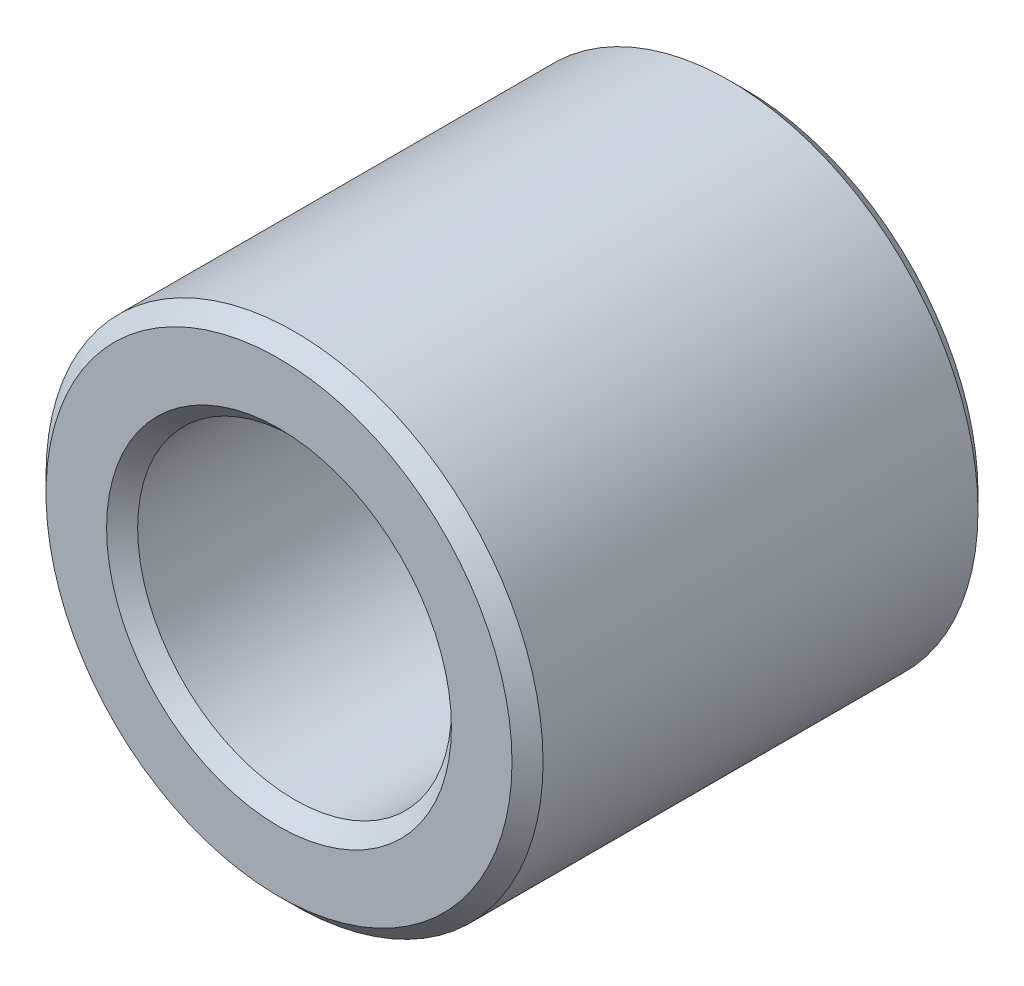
ISO-10303-21;
HEADER;
FILE_DESCRIPTION(('STEP AP214'),'2;1');
FILE_NAME('part.step','',(''),(''),'','','');
FILE_SCHEMA(('AUTOMOTIVE_DESIGN { 1 0 10303 214 1 1 1 1 }'));
ENDSEC;
DATA;
#1=APPLICATION_CONTEXT('core data for automotive mechanical design processes');
#2=APPLICATION_PROTOCOL_DEFINITION('international standard','automotive_design',2000,#1);
#3=PRODUCT_CONTEXT('',#1,'mechanical');
#4=PRODUCT('Part','Part','',(#3));
#5=PRODUCT_RELATED_PRODUCT_CATEGORY('part','',(#4));
#6=PRODUCT_DEFINITION_FORMATION('','',#4);
#7=PRODUCT_DEFINITION_CONTEXT('part definition',#1,'design');
#8=PRODUCT_DEFINITION('design','',#6,#7);
#9=PRODUCT_DEFINITION_SHAPE('','',#8);
#10=(LENGTH_UNIT() NAMED_UNIT(*) SI_UNIT(.MILLI.,.METRE.));
#11=(NAMED_UNIT(*) PLANE_ANGLE_UNIT() SI_UNIT($,.RADIAN.));
#12=(NAMED_UNIT(*) SI_UNIT($,.STERADIAN.) SOLID_ANGLE_UNIT());
#13=UNCERTAINTY_MEASURE_WITH_UNIT(LENGTH_MEASURE(1.E-05),#10,'distance_accuracy_value','');
#14=(GEOMETRIC_REPRESENTATION_CONTEXT(3) GLOBAL_UNCERTAINTY_ASSIGNED_CONTEXT((#13)) GLOBAL_UNIT_ASSIGNED_CONTEXT((#10,
#11,#12)) REPRESENTATION_CONTEXT('',''));
#15=CARTESIAN_POINT('',(0.,0.,0.));
#16=DIRECTION('',(0.,0.,1.));
#17=DIRECTION('',(1.,0.,0.));
#18=AXIS2_PLACEMENT_3D('',#15,#16,#17);
#19=CARTESIAN_POINT('',(0.,0.,15.));
#20=DIRECTION('',(0.,0.,1.));
#21=DIRECTION('',(1.,0.,0.));
#22=AXIS2_PLACEMENT_3D('',#19,#20,#21);
#23=PLANE('',#22);
#24=CARTESIAN_POINT('',(0.,0.,15.));
#25=DIRECTION('',(0.,0.,1.));
#26=DIRECTION('',(1.,0.,0.));
#27=AXIS2_PLACEMENT_3D('',#24,#25,#26);
#28=CIRCLE('',#27,5.55);
#29=CARTESIAN_POINT('',(5.55,0.,15.));
#30=VERTEX_POINT('',#29);
#31=EDGE_CURVE('E10',#30,#30,#28,.F.);
#32=ORIENTED_EDGE('',*,*,#31,.T.);
#33=EDGE_LOOP('',(#32));
#34=FACE_BOUND('',#33,.T.);
#35=CARTESIAN_POINT('',(0.,0.,15.));
#36=DIRECTION('',(0.,0.,1.));
#37=DIRECTION('',(1.,0.,0.));
#38=AXIS2_PLACEMENT_3D('',#35,#36,#37);
#39=CIRCLE('',#38,7.49999999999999);
#40=CARTESIAN_POINT('',(7.49999999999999,0.,15.));
#41=VERTEX_POINT('',#40);
#42=EDGE_CURVE('E36',#41,#41,#39,.T.);
#43=ORIENTED_EDGE('',*,*,#42,.T.);
#44=EDGE_LOOP('',(#43));
#45=FACE_BOUND('',#44,.T.);
#46=ADVANCED_FACE('F29',(#34,#45),#23,.T.);
#47=CARTESIAN_POINT('',(0.,0.,0.));
#48=DIRECTION('',(0.,0.,1.));
#49=DIRECTION('',(1.,0.,0.));
#50=AXIS2_PLACEMENT_3D('',#47,#48,#49);
#51=PLANE('',#50);
#52=CARTESIAN_POINT('',(0.,0.,0.));
#53=DIRECTION('',(0.,0.,1.));
#54=DIRECTION('',(1.,0.,0.));
#55=AXIS2_PLACEMENT_3D('',#52,#53,#54);
#56=CIRCLE('',#55,5.55);
#57=CARTESIAN_POINT('',(5.55,0.,0.));
#58=VERTEX_POINT('',#57);
#59=EDGE_CURVE('E55',#58,#58,#56,.T.);
#60=ORIENTED_EDGE('',*,*,#59,.T.);
#61=EDGE_LOOP('',(#60));
#62=FACE_BOUND('',#61,.T.);
#63=CARTESIAN_POINT('',(0.,0.,0.));
#64=DIRECTION('',(0.,0.,1.));
#65=DIRECTION('',(1.,0.,0.));
#66=AXIS2_PLACEMENT_3D('',#63,#64,#65);
#67=CIRCLE('',#66,7.49999999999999);
#68=CARTESIAN_POINT('',(7.49999999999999,0.,0.));
#69=VERTEX_POINT('',#68);
#70=EDGE_CURVE('E58',#69,#69,#67,.F.);
#71=ORIENTED_EDGE('',*,*,#70,.T.);
#72=EDGE_LOOP('',(#71));
#73=FACE_BOUND('',#72,.T.);
#74=ADVANCED_FACE('F62',(#62,#73),#51,.F.);
#75=CARTESIAN_POINT('',(0.,0.,15.));
#76=DIRECTION('',(0.,0.,-1.));
#77=DIRECTION('',(-1.,0.,0.));
#78=AXIS2_PLACEMENT_3D('',#75,#76,#77);
#79=CYLINDRICAL_SURFACE('',#78,8.);
#80=CARTESIAN_POINT('',(0.,0.,0.500000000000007));
#81=DIRECTION('',(0.,0.,1.));
#82=DIRECTION('',(1.,0.,0.));
#83=AXIS2_PLACEMENT_3D('',#80,#81,#82);
#84=CIRCLE('',#83,8.);
#85=CARTESIAN_POINT('',(8.,0.,0.500000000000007));
#86=VERTEX_POINT('',#85);
#87=EDGE_CURVE('E40',#86,#86,#84,.T.);
#88=ORIENTED_EDGE('',*,*,#87,.T.);
#89=EDGE_LOOP('',(#88));
#90=FACE_BOUND('',#89,.T.);
#91=CARTESIAN_POINT('',(0.,0.,14.5));
#92=DIRECTION('',(0.,0.,1.));
#93=DIRECTION('',(1.,0.,0.));
#94=AXIS2_PLACEMENT_3D('',#91,#92,#93);
#95=CIRCLE('',#94,8.);
#96=CARTESIAN_POINT('',(8.,0.,14.5));
#97=VERTEX_POINT('',#96);
#98=EDGE_CURVE('E44',#97,#97,#95,.F.);
#99=ORIENTED_EDGE('',*,*,#98,.T.);
#100=EDGE_LOOP('',(#99));
#101=FACE_BOUND('',#100,.T.);
#102=ADVANCED_FACE('F72',(#90,#101),#79,.T.);
#103=CARTESIAN_POINT('',(0.,0.,15.));
#104=DIRECTION('',(0.,0.,-1.));
#105=DIRECTION('',(-1.,0.,0.));
#106=AXIS2_PLACEMENT_3D('',#103,#104,#105);
#107=CYLINDRICAL_SURFACE('',#106,5.05);
#108=CARTESIAN_POINT('',(0.,0.,0.500000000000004));
#109=DIRECTION('',(0.,0.,1.));
#110=DIRECTION('',(1.,0.,0.));
#111=AXIS2_PLACEMENT_3D('',#108,#109,#110);
#112=CIRCLE('',#111,5.05);
#113=CARTESIAN_POINT('',(5.05,0.,0.500000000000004));
#114=VERTEX_POINT('',#113);
#115=EDGE_CURVE('E49',#114,#114,#112,.F.);
#116=ORIENTED_EDGE('',*,*,#115,.T.);
#117=EDGE_LOOP('',(#116));
#118=FACE_BOUND('',#117,.T.);
#119=CARTESIAN_POINT('',(0.,0.,14.5));
#120=DIRECTION('',(0.,0.,1.));
#121=DIRECTION('',(1.,0.,0.));
#122=AXIS2_PLACEMENT_3D('',#119,#120,#121);
#123=CIRCLE('',#122,5.05);
#124=CARTESIAN_POINT('',(5.05,0.,14.5));
#125=VERTEX_POINT('',#124);
#126=EDGE_CURVE('E52',#125,#125,#123,.T.);
#127=ORIENTED_EDGE('',*,*,#126,.T.);
#128=EDGE_LOOP('',(#127));
#129=FACE_BOUND('',#128,.T.);
#130=ADVANCED_FACE('F75',(#118,#129),#107,.F.);
#131=CARTESIAN_POINT('',(0.,0.,0.));
#132=DIRECTION('',(0.,0.,-1.));
#133=DIRECTION('',(-1.,0.,0.));
#134=AXIS2_PLACEMENT_3D('',#131,#132,#133);
#135=CONICAL_SURFACE('',#134,5.55,0.785398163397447);
#136=ORIENTED_EDGE('',*,*,#115,.F.);
#137=EDGE_LOOP('',(#136));
#138=FACE_BOUND('',#137,.T.);
#139=ORIENTED_EDGE('',*,*,#59,.F.);
#140=EDGE_LOOP('',(#139));
#141=FACE_BOUND('',#140,.T.);
#142=ADVANCED_FACE('F68',(#138,#141),#135,.F.);
#143=CARTESIAN_POINT('',(0.,0.,0.500000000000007));
#144=DIRECTION('',(0.,0.,1.));
#145=DIRECTION('',(1.,0.,0.));
#146=AXIS2_PLACEMENT_3D('',#143,#144,#145);
#147=CONICAL_SURFACE('',#146,8.,0.78539816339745);
#148=ORIENTED_EDGE('',*,*,#70,.F.);
#149=EDGE_LOOP('',(#148));
#150=FACE_BOUND('',#149,.T.);
#151=ORIENTED_EDGE('',*,*,#87,.F.);
#152=EDGE_LOOP('',(#151));
#153=FACE_BOUND('',#152,.T.);
#154=ADVANCED_FACE('F64',(#150,#153),#147,.T.);
#155=CARTESIAN_POINT('',(0.,0.,14.5));
#156=DIRECTION('',(0.,0.,1.));
#157=DIRECTION('',(1.,0.,0.));
#158=AXIS2_PLACEMENT_3D('',#155,#156,#157);
#159=CONICAL_SURFACE('',#158,5.05,0.785398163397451);
#160=ORIENTED_EDGE('',*,*,#31,.F.);
#161=EDGE_LOOP('',(#160));
#162=FACE_BOUND('',#161,.T.);
#163=ORIENTED_EDGE('',*,*,#126,.F.);
#164=EDGE_LOOP('',(#163));
#165=FACE_BOUND('',#164,.T.);
#166=ADVANCED_FACE('F67',(#162,#165),#159,.F.);
#167=CARTESIAN_POINT('',(0.,0.,15.));
#168=DIRECTION('',(0.,0.,-1.));
#169=DIRECTION('',(-1.,0.,0.));
#170=AXIS2_PLACEMENT_3D('',#167,#168,#169);
#171=CONICAL_SURFACE('',#170,7.49999999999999,0.785398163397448);
#172=ORIENTED_EDGE('',*,*,#98,.F.);
#173=EDGE_LOOP('',(#172));
#174=FACE_BOUND('',#173,.T.);
#175=ORIENTED_EDGE('',*,*,#42,.F.);
#176=EDGE_LOOP('',(#175));
#177=FACE_BOUND('',#176,.T.);
#178=ADVANCED_FACE('F31',(#174,#177),#171,.T.);
#179=CLOSED_SHELL('',(#46,#74,#102,#130,#142,#154,#166,#178));
#180=MANIFOLD_SOLID_BREP('B2',#179);
#181=ADVANCED_BREP_SHAPE_REPRESENTATION('',(#18,#180),#14);
#182=SHAPE_DEFINITION_REPRESENTATION(#9,#181);
ENDSEC;
END-ISO-10303-21;
